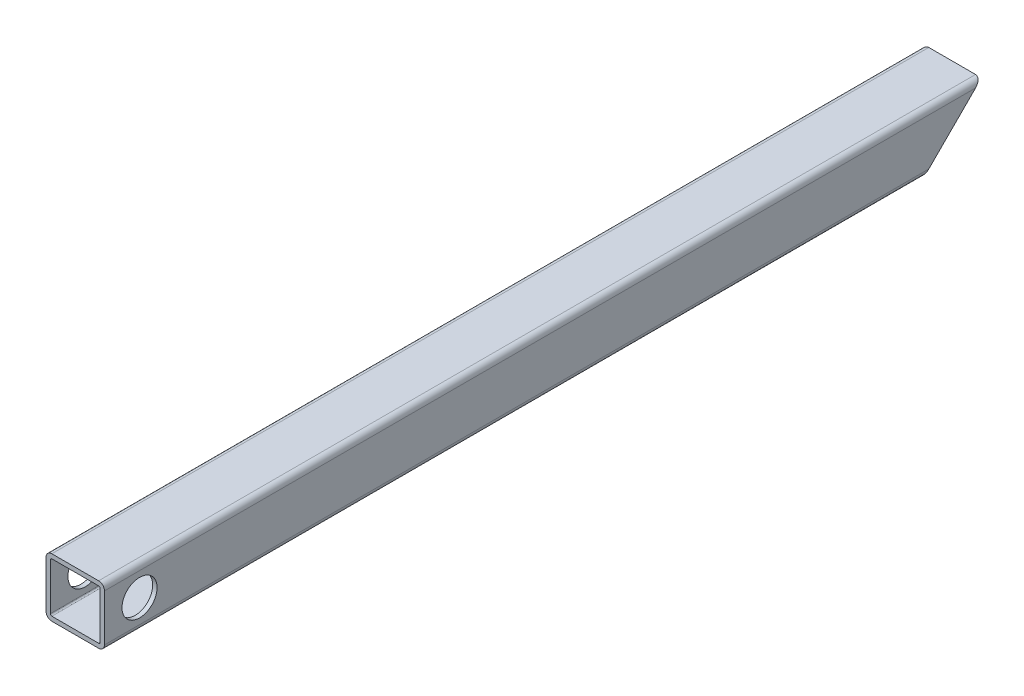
from build123d import *

# Parameters (mm, degrees)
ESQUISSE1_W           = 20
ESQUISSE1_H           = 20
ESQUISSE1_W_2         = 17
ESQUISSE1_H_2         = 17
EXTRUSION1_DEPTH      = 300
EXTRUSION2_DEPTH      = 302.330383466
EXTRUSION2_DEPTH_BACK = 302.330383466
ESQUISSE3_R           = 6
EXTRUSION3_DEPTH      = 302.330383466
CONG_1_R              = 2
CONG_2_R              = 0.5


with BuildPart() as part:
    # Esquisse1 → Extrusion1 (new body)
    with BuildSketch(Plane.XY):
        with Locations((0, 10)):
            Rectangle(ESQUISSE1_W, ESQUISSE1_H)
        with Locations((0, 10)):
            Rectangle(ESQUISSE1_W_2, ESQUISSE1_H_2, mode=Mode.SUBTRACT)
    extrude(amount=EXTRUSION1_DEPTH)

    # Esquisse2 → Extrusion2 (cut, two sides: drawn at the far end of the back side and taken through both)
    with BuildSketch(Plane(origin=(10, 0, 0), x_dir=(0, 0, -1), z_dir=(1, 0, 0)).offset(-EXTRUSION2_DEPTH_BACK)):
        Polygon((-20, 0), (0, 0), (0, 1.157044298), (0, 20), align=None)
    extrude(amount=EXTRUSION2_DEPTH + EXTRUSION2_DEPTH_BACK, mode=Mode.SUBTRACT)

    # Esquisse3 → Extrusion3 (cut, through all)
    with BuildSketch(Plane(origin=(10, 0, 0), x_dir=(0, 0, -1), z_dir=(1, 0, 0))):
        with Locations(Location((-288, 10, 0), (0, 0, 90))):
            Circle(ESQUISSE3_R)
    extrude(amount=-EXTRUSION3_DEPTH, mode=Mode.SUBTRACT)

    # Cong_1
    cong_1_edges = [part.edges().sort_by_distance(p)[0] for p in [
        (-10, 20, 150),
        (10, 20, 150),
        (10, 0, 160),
        (-10, 0, 160),
    ]]
    fillet(cong_1_edges, radius=CONG_1_R)

    # Cong_2
    cong_2_edges = [part.edges().sort_by_distance(p)[0] for p in [
        (-8.5, 18.5, 150.75),
        (-8.5, 1.5, 159.25),
        (8.5, 1.5, 159.25),
        (8.5, 18.5, 150.75),
    ]]
    fillet(cong_2_edges, radius=CONG_2_R)


solid = part.part
